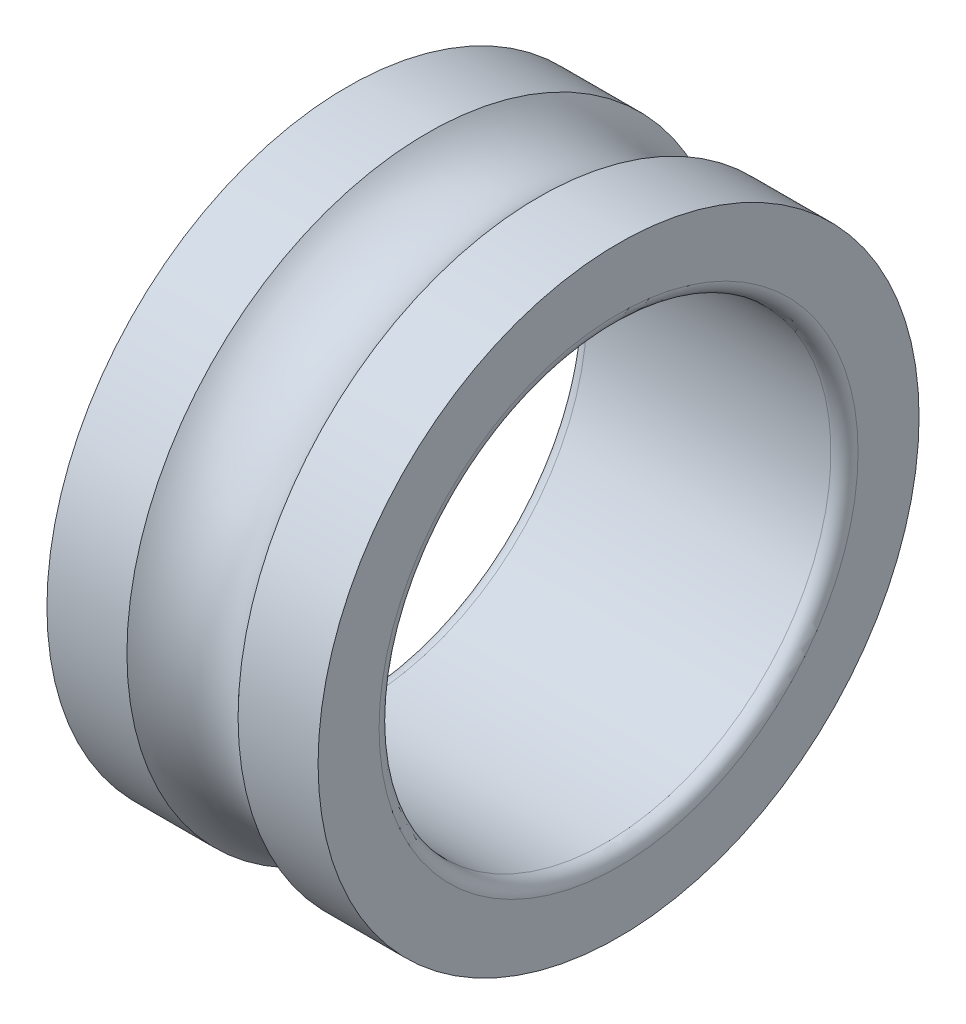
ISO-10303-21;
HEADER;
FILE_DESCRIPTION(('STEP AP214'),'2;1');
FILE_NAME('part.step','',(''),(''),'','','');
FILE_SCHEMA(('AUTOMOTIVE_DESIGN { 1 0 10303 214 1 1 1 1 }'));
ENDSEC;
DATA;
#1=APPLICATION_CONTEXT('core data for automotive mechanical design processes');
#2=APPLICATION_PROTOCOL_DEFINITION('international standard','automotive_design',2000,#1);
#3=PRODUCT_CONTEXT('',#1,'mechanical');
#4=PRODUCT('Part','Part','',(#3));
#5=PRODUCT_RELATED_PRODUCT_CATEGORY('part','',(#4));
#6=PRODUCT_DEFINITION_FORMATION('','',#4);
#7=PRODUCT_DEFINITION_CONTEXT('part definition',#1,'design');
#8=PRODUCT_DEFINITION('design','',#6,#7);
#9=PRODUCT_DEFINITION_SHAPE('','',#8);
#10=(LENGTH_UNIT() NAMED_UNIT(*) SI_UNIT(.MILLI.,.METRE.));
#11=(NAMED_UNIT(*) PLANE_ANGLE_UNIT() SI_UNIT($,.RADIAN.));
#12=(NAMED_UNIT(*) SI_UNIT($,.STERADIAN.) SOLID_ANGLE_UNIT());
#13=UNCERTAINTY_MEASURE_WITH_UNIT(LENGTH_MEASURE(1.E-05),#10,'distance_accuracy_value','');
#14=(GEOMETRIC_REPRESENTATION_CONTEXT(3) GLOBAL_UNCERTAINTY_ASSIGNED_CONTEXT((#13)) GLOBAL_UNIT_ASSIGNED_CONTEXT((#10,
#11,#12)) REPRESENTATION_CONTEXT('',''));
#15=CARTESIAN_POINT('',(0.,0.,0.));
#16=DIRECTION('',(0.,0.,1.));
#17=DIRECTION('',(1.,0.,0.));
#18=AXIS2_PLACEMENT_3D('',#15,#16,#17);
#19=CARTESIAN_POINT('',(0.600000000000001,0.,0.));
#20=DIRECTION('',(-1.,0.,0.));
#21=DIRECTION('',(0.,0.,1.));
#22=AXIS2_PLACEMENT_3D('',#19,#20,#21);
#23=TOROIDAL_SURFACE('',#22,10.6,0.600000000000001);
#24=CARTESIAN_POINT('',(0.600000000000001,0.,0.));
#25=DIRECTION('',(-1.,0.,0.));
#26=DIRECTION('',(0.,0.,1.));
#27=AXIS2_PLACEMENT_3D('',#24,#25,#26);
#28=CIRCLE('',#27,10.);
#29=CARTESIAN_POINT('',(0.600000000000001,0.,10.));
#30=VERTEX_POINT('',#29);
#31=EDGE_CURVE('E10',#30,#30,#28,.T.);
#32=ORIENTED_EDGE('',*,*,#31,.F.);
#33=EDGE_LOOP('',(#32));
#34=FACE_BOUND('',#33,.T.);
#35=CARTESIAN_POINT('',(0.,0.,0.));
#36=DIRECTION('',(-1.,0.,0.));
#37=DIRECTION('',(0.,0.,1.));
#38=AXIS2_PLACEMENT_3D('',#35,#36,#37);
#39=CIRCLE('',#38,10.6);
#40=CARTESIAN_POINT('',(0.,0.,10.6));
#41=VERTEX_POINT('',#40);
#42=EDGE_CURVE('E57',#41,#41,#39,.T.);
#43=ORIENTED_EDGE('',*,*,#42,.T.);
#44=EDGE_LOOP('',(#43));
#45=FACE_BOUND('',#44,.T.);
#46=ADVANCED_FACE('F29',(#34,#45),#23,.T.);
#47=CARTESIAN_POINT('',(0.,0.,0.));
#48=DIRECTION('',(-1.,0.,0.));
#49=DIRECTION('',(0.,0.,1.));
#50=AXIS2_PLACEMENT_3D('',#47,#48,#49);
#51=CYLINDRICAL_SURFACE('',#50,10.);
#52=CARTESIAN_POINT('',(11.4,0.,0.));
#53=DIRECTION('',(-1.,0.,0.));
#54=DIRECTION('',(0.,0.,1.));
#55=AXIS2_PLACEMENT_3D('',#52,#53,#54);
#56=CIRCLE('',#55,10.);
#57=CARTESIAN_POINT('',(11.4,0.,10.));
#58=VERTEX_POINT('',#57);
#59=EDGE_CURVE('E35',#58,#58,#56,.T.);
#60=ORIENTED_EDGE('',*,*,#59,.F.);
#61=EDGE_LOOP('',(#60));
#62=FACE_BOUND('',#61,.T.);
#63=ORIENTED_EDGE('',*,*,#31,.T.);
#64=EDGE_LOOP('',(#63));
#65=FACE_BOUND('',#64,.T.);
#66=ADVANCED_FACE('F94',(#62,#65),#51,.F.);
#67=CARTESIAN_POINT('',(11.4,0.,0.));
#68=DIRECTION('',(-1.,0.,0.));
#69=DIRECTION('',(0.,0.,1.));
#70=AXIS2_PLACEMENT_3D('',#67,#68,#69);
#71=TOROIDAL_SURFACE('',#70,10.6,0.600000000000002);
#72=CARTESIAN_POINT('',(12.,0.,0.));
#73=DIRECTION('',(-1.,0.,0.));
#74=DIRECTION('',(0.,0.,1.));
#75=AXIS2_PLACEMENT_3D('',#72,#73,#74);
#76=CIRCLE('',#75,10.6);
#77=CARTESIAN_POINT('',(12.,0.,10.6));
#78=VERTEX_POINT('',#77);
#79=EDGE_CURVE('E39',#78,#78,#76,.T.);
#80=ORIENTED_EDGE('',*,*,#79,.F.);
#81=EDGE_LOOP('',(#80));
#82=FACE_BOUND('',#81,.T.);
#83=ORIENTED_EDGE('',*,*,#59,.T.);
#84=EDGE_LOOP('',(#83));
#85=FACE_BOUND('',#84,.T.);
#86=ADVANCED_FACE('F89',(#82,#85),#71,.T.);
#87=CARTESIAN_POINT('',(12.,0.,-13.3));
#88=DIRECTION('',(-1.,0.,0.));
#89=DIRECTION('',(0.,0.,1.));
#90=AXIS2_PLACEMENT_3D('',#87,#88,#89);
#91=PLANE('',#90);
#92=CARTESIAN_POINT('',(12.,0.,0.));
#93=DIRECTION('',(-1.,0.,0.));
#94=DIRECTION('',(0.,0.,1.));
#95=AXIS2_PLACEMENT_3D('',#92,#93,#94);
#96=CIRCLE('',#95,13.3);
#97=CARTESIAN_POINT('',(12.,0.,13.3));
#98=VERTEX_POINT('',#97);
#99=EDGE_CURVE('E43',#98,#98,#96,.T.);
#100=ORIENTED_EDGE('',*,*,#99,.F.);
#101=EDGE_LOOP('',(#100));
#102=FACE_BOUND('',#101,.T.);
#103=ORIENTED_EDGE('',*,*,#79,.T.);
#104=EDGE_LOOP('',(#103));
#105=FACE_BOUND('',#104,.T.);
#106=ADVANCED_FACE('F83',(#102,#105),#91,.F.);
#107=CARTESIAN_POINT('',(0.,0.,0.));
#108=DIRECTION('',(-1.,0.,0.));
#109=DIRECTION('',(0.,0.,1.));
#110=AXIS2_PLACEMENT_3D('',#107,#108,#109);
#111=CYLINDRICAL_SURFACE('',#110,13.3);
#112=CARTESIAN_POINT('',(8.45967477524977,0.,0.));
#113=DIRECTION('',(-1.,0.,0.));
#114=DIRECTION('',(0.,0.,1.));
#115=AXIS2_PLACEMENT_3D('',#112,#113,#114);
#116=CIRCLE('',#115,13.3);
#117=CARTESIAN_POINT('',(8.45967477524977,0.,13.3));
#118=VERTEX_POINT('',#117);
#119=EDGE_CURVE('E48',#118,#118,#116,.T.);
#120=ORIENTED_EDGE('',*,*,#119,.F.);
#121=EDGE_LOOP('',(#120));
#122=FACE_BOUND('',#121,.T.);
#123=ORIENTED_EDGE('',*,*,#99,.T.);
#124=EDGE_LOOP('',(#123));
#125=FACE_BOUND('',#124,.T.);
#126=ADVANCED_FACE('F77',(#122,#125),#111,.T.);
#127=CARTESIAN_POINT('',(6.,0.,0.));
#128=DIRECTION('',(-1.,0.,0.));
#129=DIRECTION('',(0.,0.,1.));
#130=AXIS2_PLACEMENT_3D('',#127,#128,#129);
#131=TOROIDAL_SURFACE('',#130,15.5,3.3);
#132=CARTESIAN_POINT('',(3.54032522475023,0.,0.));
#133=DIRECTION('',(-1.,0.,0.));
#134=DIRECTION('',(0.,0.,1.));
#135=AXIS2_PLACEMENT_3D('',#132,#133,#134);
#136=CIRCLE('',#135,13.3);
#137=CARTESIAN_POINT('',(3.54032522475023,0.,13.3));
#138=VERTEX_POINT('',#137);
#139=EDGE_CURVE('E51',#138,#138,#136,.T.);
#140=ORIENTED_EDGE('',*,*,#139,.F.);
#141=EDGE_LOOP('',(#140));
#142=FACE_BOUND('',#141,.T.);
#143=ORIENTED_EDGE('',*,*,#119,.T.);
#144=EDGE_LOOP('',(#143));
#145=FACE_BOUND('',#144,.T.);
#146=ADVANCED_FACE('F71',(#142,#145),#131,.F.);
#147=CARTESIAN_POINT('',(0.,0.,0.));
#148=DIRECTION('',(-1.,0.,0.));
#149=DIRECTION('',(0.,0.,1.));
#150=AXIS2_PLACEMENT_3D('',#147,#148,#149);
#151=CYLINDRICAL_SURFACE('',#150,13.3);
#152=CARTESIAN_POINT('',(0.,0.,0.));
#153=DIRECTION('',(-1.,0.,0.));
#154=DIRECTION('',(0.,0.,1.));
#155=AXIS2_PLACEMENT_3D('',#152,#153,#154);
#156=CIRCLE('',#155,13.3);
#157=CARTESIAN_POINT('',(0.,0.,13.3));
#158=VERTEX_POINT('',#157);
#159=EDGE_CURVE('E54',#158,#158,#156,.T.);
#160=ORIENTED_EDGE('',*,*,#159,.F.);
#161=EDGE_LOOP('',(#160));
#162=FACE_BOUND('',#161,.T.);
#163=ORIENTED_EDGE('',*,*,#139,.T.);
#164=EDGE_LOOP('',(#163));
#165=FACE_BOUND('',#164,.T.);
#166=ADVANCED_FACE('F65',(#162,#165),#151,.T.);
#167=CARTESIAN_POINT('',(0.,0.,-13.3));
#168=DIRECTION('',(1.,0.,0.));
#169=DIRECTION('',(0.,0.,-1.));
#170=AXIS2_PLACEMENT_3D('',#167,#168,#169);
#171=PLANE('',#170);
#172=ORIENTED_EDGE('',*,*,#42,.F.);
#173=EDGE_LOOP('',(#172));
#174=FACE_BOUND('',#173,.T.);
#175=ORIENTED_EDGE('',*,*,#159,.T.);
#176=EDGE_LOOP('',(#175));
#177=FACE_BOUND('',#176,.T.);
#178=ADVANCED_FACE('F62',(#174,#177),#171,.F.);
#179=CLOSED_SHELL('',(#46,#66,#86,#106,#126,#146,#166,#178));
#180=MANIFOLD_SOLID_BREP('B2',#179);
#181=ADVANCED_BREP_SHAPE_REPRESENTATION('',(#18,#180),#14);
#182=SHAPE_DEFINITION_REPRESENTATION(#9,#181);
ENDSEC;
END-ISO-10303-21;
